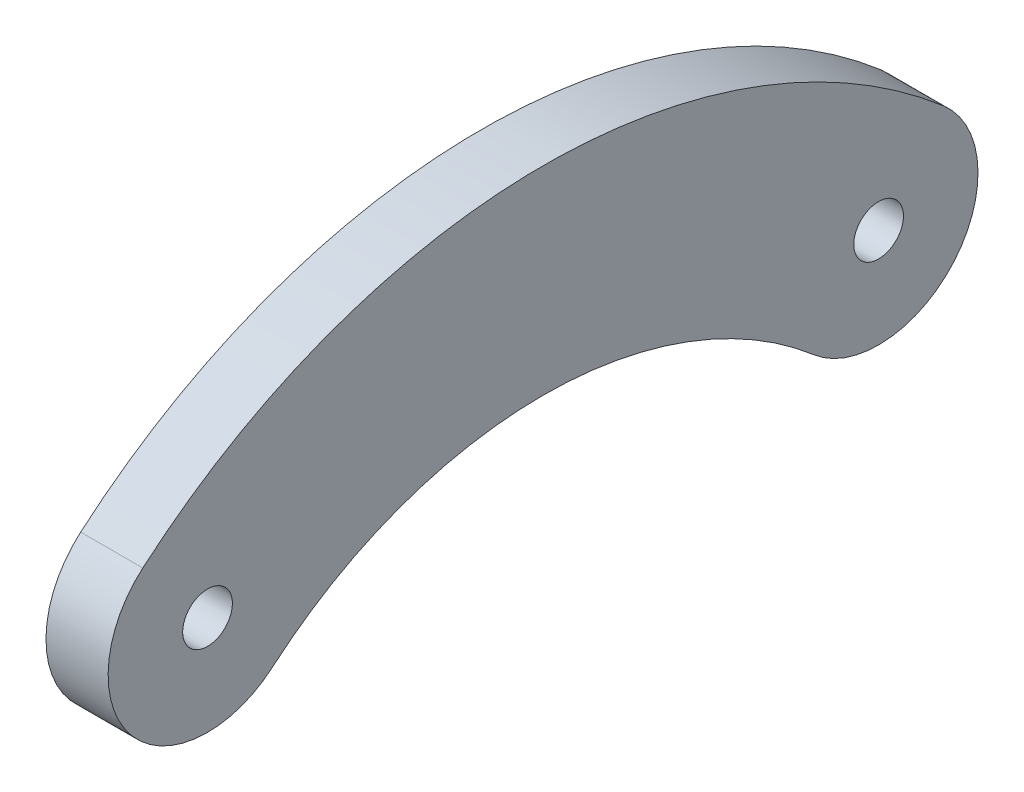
from build123d import *

# Parameters (mm, degrees)
SKETCH_1_R      = 1
EXTRUDE_1_DEPTH = 1.25


with BuildPart() as part:
    # Sketch 1 → Extrude 1 (new, symmetric)
    with BuildSketch(Plane(origin=(0, 0, 0), x_dir=(0, 0, -1), z_dir=(1, 0, 0))):
        with BuildLine():
            ThreePointArc((29.605548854, 3.034981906), (13.5, 9), (-2.605548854, 3.034981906))
            ThreePointArc((-2.605548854, 3.034981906), (-3.034981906, -2.605548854), (2.605548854, -3.034981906))
            ThreePointArc((2.605548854, -3.034981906), (13.5, 1), (24.394451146, -3.034981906))
            ThreePointArc((24.394451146, -3.034981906), (30.034981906, -2.605548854), (29.605548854, 3.034981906))
        make_face()
        Circle(SKETCH_1_R, mode=Mode.SUBTRACT)
        with Locations((27, 0)):
            Circle(SKETCH_1_R, mode=Mode.SUBTRACT)
    extrude(amount=EXTRUDE_1_DEPTH, both=True)


solid = part.part
